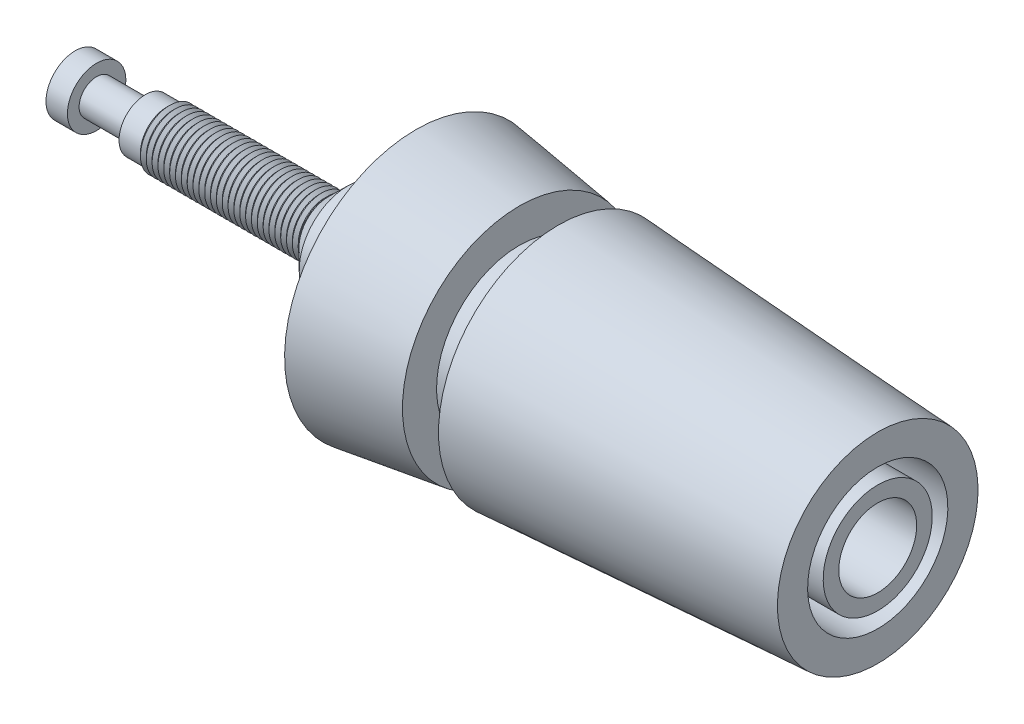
from build123d import *

# Parameters (mm, degrees)
SKICA3_R                 = 3.6
SKICA3_R_2               = 2.8
SKICA3_R_3               = 2
ODEBRAT_VYSUNUT_M1_DEPTH = 16
ODEBRAT_VYSUNUT_M4_DEPTH = 0.5


with BuildPart() as part:
    # Skica1 → Rotovat1 (revolve)
    with BuildSketch(Plane.XY):
        Polygon((-41.250127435, 0), (-41.250127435, 1.5), (-40.150127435, 1.5), (-40.150127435, 0.9), (-37.650127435, 0.9), (-37.650127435, 1.35), (-36.550127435, 1.35), (-36.400127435, 1.5), (-36.250127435, 1.35), (-36.100127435, 1.5), (-35.950127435, 1.35), (-35.800127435, 1.5), (-35.650127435, 1.35), (-35.500127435, 1.5), (-35.350127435, 1.35), (-35.200127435, 1.5), (-35.050127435, 1.35), (-34.900127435, 1.5), (-34.750127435, 1.35), (-34.600127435, 1.5), (-34.450127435, 1.35), (-34.300127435, 1.5), (-34.150127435, 1.35), (-34.000127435, 1.5), (-33.850127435, 1.35), (-33.700127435, 1.5), (-33.550127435, 1.35), (-33.400127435, 1.5), (-33.250127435, 1.35), (-33.100127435, 1.5), (-32.950127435, 1.35), (-32.800127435, 1.5), (-32.650127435, 1.35), (-32.500127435, 1.5), (-32.350127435, 1.35), (-32.200127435, 1.5), (-32.050127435, 1.35), (-31.900127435, 1.5), (-31.750127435, 1.35), (-31.600127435, 1.5), (-31.450127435, 1.35), (-31.300127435, 1.5), (-31.150127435, 1.35), (-31.000127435, 1.5), (-30.850127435, 1.35), (-30.700127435, 1.5), (-30.550127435, 1.35), (-30.400127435, 1.5), (-30.250127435, 1.35), (-30.100127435, 1.5), (-29.950127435, 1.35), (-29.800127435, 1.5), (-29.650127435, 1.35), (-29.500127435, 1.5), (-29.350127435, 1.35), (-29.200127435, 1.5), (-29.050127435, 1.35), (-28.900127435, 1.5), (-28.750127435, 1.35), (-28.600127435, 1.5), (-28.450127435, 1.35), (-28.300127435, 1.5), (-28.261803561, 1.5), (-27.250127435, 2.5), (-24.250127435, 2.5), (-24.250127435, 4.5), (-23.750127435, 4.5), (-23.750127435, 6.75), (-18.450127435, 6), (-18.450127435, 4.25), (-16.450127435, 4.25), (-16.450127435, 6.15), (-0.050127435, 5.15), (-0.050127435, 0), align=None)
    revolve(axis=Axis((-0.050127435, 0, 0), (-1, 0, 0)))

    # Skica3 → Odebrat vysunut_m1 (cut)
    # profile 1 of 2: a face of its own
    with BuildSketch(Plane(origin=(-0.050127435, 0, 0), x_dir=(0, 0, -1), z_dir=(1, 0, 0))):
        with Locations(Location((0, 0, 0), (0, 0, 90))):
            Circle(SKICA3_R)
        with Locations(Location((0, 0, 0), (0, 0, 90))):
            Circle(SKICA3_R_2, mode=Mode.SUBTRACT)
    # profile 2 of 2: a face of its own
    with BuildSketch(Plane(origin=(-0.050127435, 0, 0), x_dir=(0, 0, -1), z_dir=(1, 0, 0))):
        with Locations(Location((0, 0, 0), (0, 0, 90))):
            Circle(SKICA3_R_3)
    extrude(amount=-ODEBRAT_VYSUNUT_M1_DEPTH, mode=Mode.SUBTRACT)

    # Skica4 → Odebrat vysunut_m4 (cut)
    with BuildSketch(Plane.ZY.offset(24.250127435)):
        Polygon((3.9, 40.125627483), (3.9, 2.244994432), (3.9, -2.244994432), (3.9, -40.125627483), (79.661266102, -40.125627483), (79.661266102, 40.125627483), align=None)
    extrude(amount=-ODEBRAT_VYSUNUT_M4_DEPTH, mode=Mode.SUBTRACT)


solid = part.part
